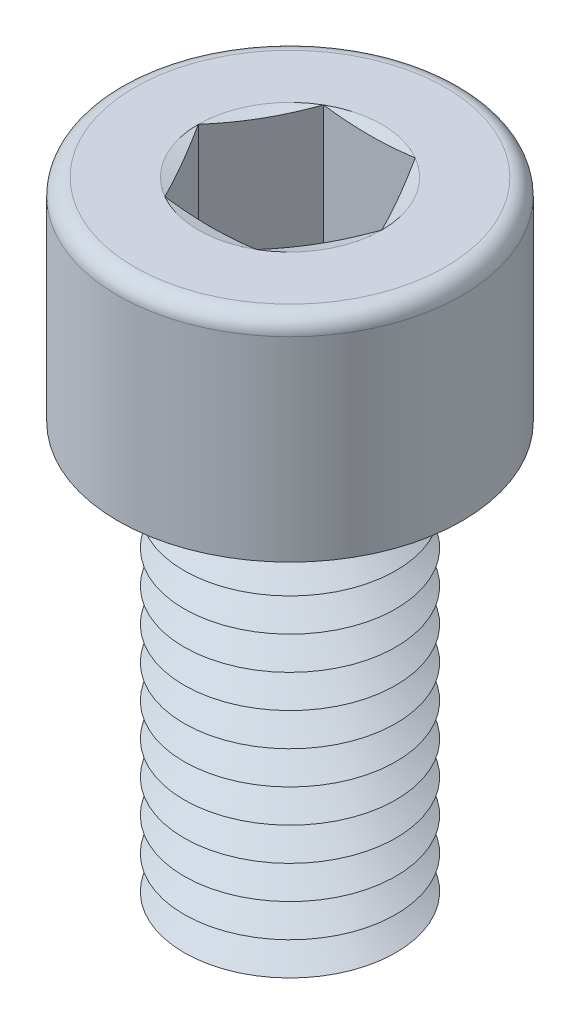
from build123d import *

# Parameters (mm, degrees)
SKETCH1_R       = 4
EXTRUDE1_DEPTH  = 16
SKETCH2_R       = 6.5
EXTRUDE2_DEPTH  = 8
EXTRUDE3_DEPTH  = 6
FILLET1_R       = 0.625
LPATTERN1_COUNT = 13
LPATTERN1_PITCH = 1.25


with BuildPart() as part:
    # Sketch1 → Extrude1 (new body)
    with BuildSketch(Plane(origin=(0, 0, 0), x_dir=(1, 0, 0), z_dir=(0, 1, 0))):
        with Locations(Location((0, 0, 0), (0, 0, 270))):
            Circle(SKETCH1_R)
    extrude(amount=EXTRUDE1_DEPTH)

    # Sketch2 → Extrude2 (add)
    with BuildSketch(Plane(origin=(0, 16, 0), x_dir=(1, 0, 0), z_dir=(0, 1, 0))):
        with Locations(Location((0, 0, 0), (0, 0, 270))):
            Circle(SKETCH2_R)
    extrude(amount=EXTRUDE2_DEPTH)

    # Sketch3 → Extrude3 (cut)
    with BuildSketch(Plane(origin=(0, 24, 0), x_dir=(1, 0, 0), z_dir=(0, 1, 0))):
        Polygon((1.732050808, 3), (-1.732050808, 3), (-3.464101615, 0), (-1.732050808, -3), (1.732050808, -3), (3.464101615, 0), align=None)
    extrude(amount=-EXTRUDE3_DEPTH, mode=Mode.SUBTRACT)

    # Fillet1
    fillet1_edges = [part.edges().sort_by_distance(p)[0] for p in [
        (0, 24, -6.5),
    ]]
    fillet(fillet1_edges, radius=FILLET1_R)

    # Sketch4 → Cut-Revolve1 (revolve, cut)
    with BuildSketch(Plane(origin=(0, 0, 0), x_dir=(0, 0, -1), z_dir=(1, 0, 0))):
        Polygon((-3, 18), (0, 18), (0, 16.267949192), align=None)
    revolve(axis=Axis((0, 18, 0), (0, -1, 0)), mode=Mode.SUBTRACT)

    # Sketch5 → Cut-Revolve2 (revolve, cut)
    with BuildSketch(Plane.XY, mode=Mode.PRIVATE) as cut_revolve2_sk:
        Polygon((-4, 0.625), (-4, -0.625), (-2.917468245, 0), align=None)
    cut_revolve2 = revolve(cut_revolve2_sk.sketch.rotate(Axis((0, 16, 0), (0, -1, 0)), 270), axis=Axis((0, 16, 0), (0, -1, 0)), mode=Mode.SUBTRACT)

    # LPattern1: Cut-Revolve2 ×13
    with Locations(*[(0, i * LPATTERN1_PITCH, 0) for i in range(1, LPATTERN1_COUNT)]):
        add(cut_revolve2, mode=Mode.SUBTRACT)

    # Extrude4 cone 1 section (on through the dimple's axis) → Extrude4 (revolve, cut)
    with BuildSketch(Plane(origin=(0, 24, 0), x_dir=(0, 0, 1), z_dir=(1, 0, 0))):
        Polygon((0, 0), (3.464101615, 0), (0, 0.92820323), align=None)
    revolve(axis=Axis((0, 24, 0), (0, -1, 0)), mode=Mode.SUBTRACT)


solid = part.part
